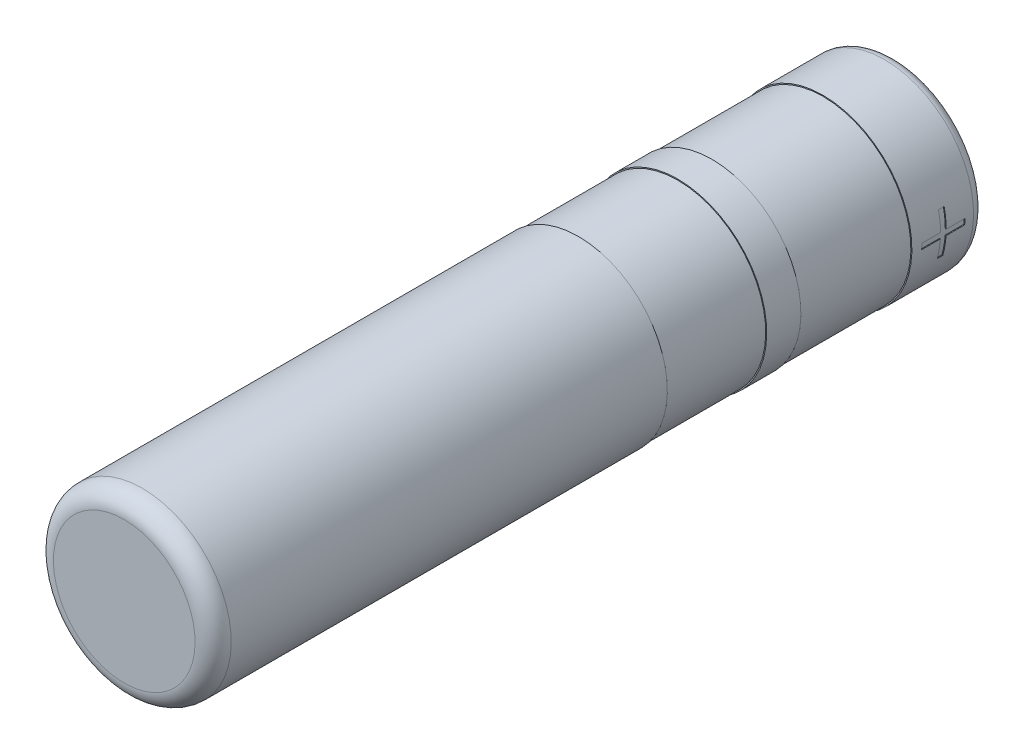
from build123d import *

# Parameters (mm, degrees)
ENL_V_MAT_EXTRU_1_REACH      = 47.603
ENL_V_MAT_EXTRU_1_END_RADIUS = 4.915


with BuildPart() as part:
    # Esquisse1 → R_volution1 (revolve)
    with BuildSketch(Plane(origin=(0, 0, 0), x_dir=(0, 0, -1), z_dir=(1, 0, 0))):
        with BuildLine():
            Line((0, 0), (0, 3.915))
            ThreePointArc((0, 3.915), (0.292893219, 4.622106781), (1, 4.915))
            Line((1, 4.915), (25.11059485, 4.915))
            Line((25.11059485, 4.915), (25.11059485, 4.859010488))
            Line((25.11059485, 4.859010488), (30.604935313, 4.859010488))
            Line((30.604935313, 4.859010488), (30.604935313, 4.915))
            Line((30.604935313, 4.915), (32.495844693, 4.915))
            Line((32.495844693, 4.915), (32.495844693, 4.859010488))
            Line((32.495844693, 4.859010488), (38.632380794, 4.859010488))
            Line((38.632380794, 4.859010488), (38.632380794, 4.915))
            Line((38.632380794, 4.915), (42.04, 4.915))
            ThreePointArc((42.04, 4.915), (42.464264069, 4.739264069), (42.64, 4.315))
            Line((42.64, 4.315), (42.64, 1.180245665))
            Line((42.64, 1.180245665), (43.64, 1.180245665))
            ThreePointArc((43.64, 1.180245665), (44.064264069, 1.004509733), (44.24, 0.580245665))
            Line((44.24, 0.580245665), (44.24, 0))
            Line((44.24, 0), (0, 0))
        make_face()
    revolve(axis=Axis((0, 0, -44.24), (0, 0, 1)))

    # Enl_v. mat.-Extru.1: up to this cylinder (the profile starts outside it)
    enl_v_mat_extru_1_end = Plane(origin=(-0.05, 0, -40.37078), z_dir=(0, 0, -1)) * Cylinder(ENL_V_MAT_EXTRU_1_END_RADIUS, 106.036, mode=Mode.PRIVATE)
    # Esquisse2 → Enl_v. mat.-Extru.1 (cut, up to the surface)
    with BuildSketch(Plane(origin=(5, 0, 0), x_dir=(0, 0, -1), z_dir=(1, 0, 0)), mode=Mode.PRIVATE) as enl_v_mat_extru_1_sk1:
        Polygon((40.213729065, 0.009316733), (40.213729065, 1.041368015), (40.527831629, 1.041368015), (40.527831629, 0.009316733), (41.559882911, 0.009316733), (41.559882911, -0.304785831), (40.527831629, -0.304785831), (40.527831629, -1.336837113), (40.213729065, -1.336837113), (40.213729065, -0.304785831), (39.181677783, -0.304785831), (39.181677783, 0.009316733), align=None)
    enl_v_mat_extru_1_tool1 = extrude(enl_v_mat_extru_1_sk1.sketch, amount=-ENL_V_MAT_EXTRU_1_REACH, mode=Mode.PRIVATE) - enl_v_mat_extru_1_end
    add(enl_v_mat_extru_1_tool1.solids().sort_by_distance((5, -0.147735, -40.37078))[0], mode=Mode.SUBTRACT)


solid = part.part
